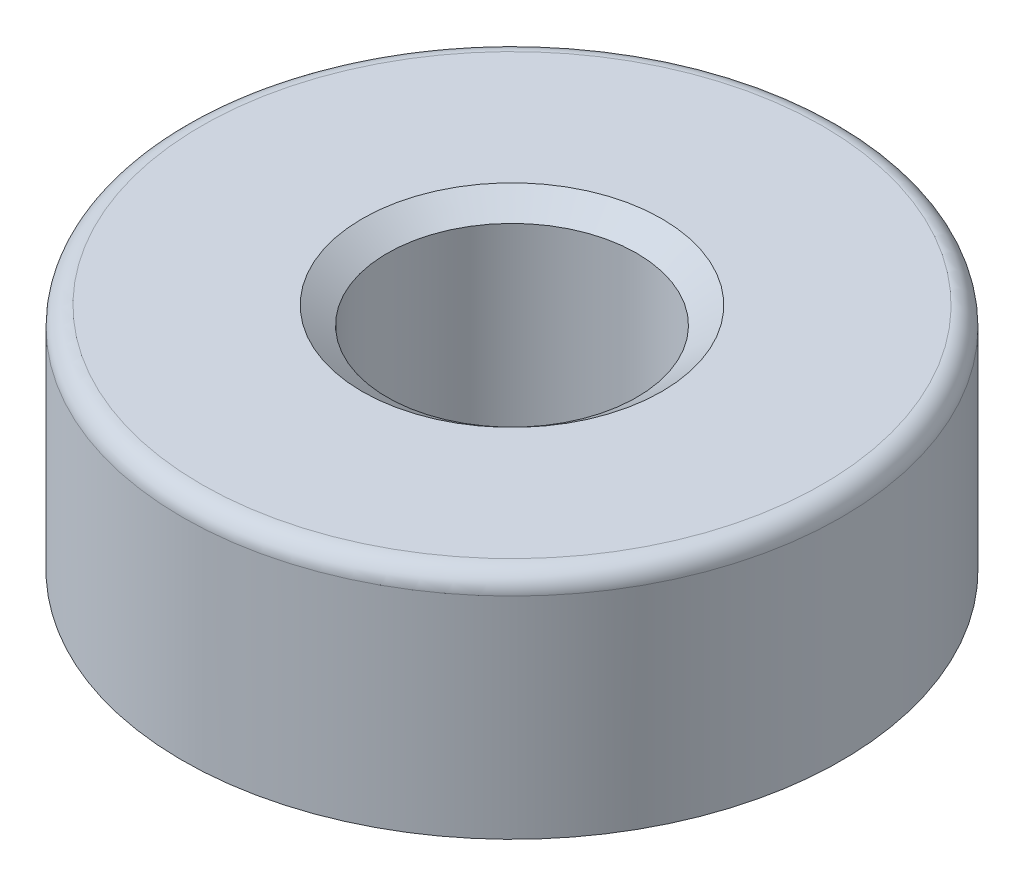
ISO-10303-21;
HEADER;
FILE_DESCRIPTION(('STEP AP214'),'2;1');
FILE_NAME('part.step','',(''),(''),'','','');
FILE_SCHEMA(('AUTOMOTIVE_DESIGN { 1 0 10303 214 1 1 1 1 }'));
ENDSEC;
DATA;
#1=APPLICATION_CONTEXT('core data for automotive mechanical design processes');
#2=APPLICATION_PROTOCOL_DEFINITION('international standard','automotive_design',2000,#1);
#3=PRODUCT_CONTEXT('',#1,'mechanical');
#4=PRODUCT('Part','Part','',(#3));
#5=PRODUCT_RELATED_PRODUCT_CATEGORY('part','',(#4));
#6=PRODUCT_DEFINITION_FORMATION('','',#4);
#7=PRODUCT_DEFINITION_CONTEXT('part definition',#1,'design');
#8=PRODUCT_DEFINITION('design','',#6,#7);
#9=PRODUCT_DEFINITION_SHAPE('','',#8);
#10=(LENGTH_UNIT() NAMED_UNIT(*) SI_UNIT(.MILLI.,.METRE.));
#11=(NAMED_UNIT(*) PLANE_ANGLE_UNIT() SI_UNIT($,.RADIAN.));
#12=(NAMED_UNIT(*) SI_UNIT($,.STERADIAN.) SOLID_ANGLE_UNIT());
#13=UNCERTAINTY_MEASURE_WITH_UNIT(LENGTH_MEASURE(1.E-05),#10,'distance_accuracy_value','');
#14=(GEOMETRIC_REPRESENTATION_CONTEXT(3) GLOBAL_UNCERTAINTY_ASSIGNED_CONTEXT((#13)) GLOBAL_UNIT_ASSIGNED_CONTEXT((#10,
#11,#12)) REPRESENTATION_CONTEXT('',''));
#15=CARTESIAN_POINT('',(0.,0.,0.));
#16=DIRECTION('',(0.,0.,1.));
#17=DIRECTION('',(1.,0.,0.));
#18=AXIS2_PLACEMENT_3D('',#15,#16,#17);
#19=CARTESIAN_POINT('',(0.,-0.62,0.));
#20=DIRECTION('',(0.,1.,0.));
#21=DIRECTION('',(0.,0.,1.));
#22=AXIS2_PLACEMENT_3D('',#19,#20,#21);
#23=CONICAL_SURFACE('',#22,5.739195,0.94660466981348);
#24=CARTESIAN_POINT('',(-4.06874801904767,-0.620199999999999,4.0472782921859));
#25=CARTESIAN_POINT('',(-4.14286310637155,-0.517112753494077,4.17564938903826));
#26=CARTESIAN_POINT('',(-4.2169246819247,-0.413872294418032,4.30392780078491));
#27=CARTESIAN_POINT('',(-4.36494079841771,-0.207084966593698,4.56029923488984));
#28=CARTESIAN_POINT('',(-4.43889533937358,-0.103538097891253,4.68839225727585));
#29=CARTESIAN_POINT('',(-4.51279636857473,0.000161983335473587,4.81639259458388));
#30=B_SPLINE_CURVE_WITH_KNOTS('',3,(#24,#25,#26,#27,#28,#29),.UNSPECIFIED.,.F.,.F.,(4,2,4),(0.,
0.54165629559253,1.08331251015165),.UNSPECIFIED.);
#31=CARTESIAN_POINT('',(-4.06889185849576,-0.62,4.04752742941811));
#32=VERTEX_POINT('',#31);
#33=CARTESIAN_POINT('',(-4.51268089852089,0.,4.81619259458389));
#34=VERTEX_POINT('',#33);
#35=EDGE_CURVE('E274',#32,#34,#30,.T.);
#36=ORIENTED_EDGE('',*,*,#35,.F.);
#37=CARTESIAN_POINT('',(0.,-0.62,0.));
#38=DIRECTION('',(0.,-1.,0.));
#39=DIRECTION('',(0.,0.,-1.));
#40=AXIS2_PLACEMENT_3D('',#37,#38,#39);
#41=CIRCLE('',#40,5.739195);
#42=CARTESIAN_POINT('',(-1.4708156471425,-0.62,5.54752742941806));
#43=VERTEX_POINT('',#42);
#44=EDGE_CURVE('E215',#43,#32,#41,.T.);
#45=ORIENTED_EDGE('',*,*,#44,.F.);
#46=CARTESIAN_POINT('',(-1.91472015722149,0.000161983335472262,6.31639259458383));
#47=CARTESIAN_POINT('',(-1.84081912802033,-0.103538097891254,6.1883922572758));
#48=CARTESIAN_POINT('',(-1.76686458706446,-0.207084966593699,6.06029923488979));
#49=CARTESIAN_POINT('',(-1.61884847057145,-0.413872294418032,5.80392780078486));
#50=CARTESIAN_POINT('',(-1.5447868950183,-0.517112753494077,5.67564938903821));
#51=CARTESIAN_POINT('',(-1.47067180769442,-0.6202,5.54727829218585));
#52=B_SPLINE_CURVE_WITH_KNOTS('',3,(#46,#47,#48,#49,#50,#51),.UNSPECIFIED.,.F.,.F.,(4,2,4),(0.,
0.541656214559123,1.08331251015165),.UNSPECIFIED.);
#53=CARTESIAN_POINT('',(-1.91460468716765,0.,6.31619259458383));
#54=VERTEX_POINT('',#53);
#55=EDGE_CURVE('E187',#54,#43,#52,.T.);
#56=ORIENTED_EDGE('',*,*,#55,.F.);
#57=CARTESIAN_POINT('',(0.,0.,0.));
#58=DIRECTION('',(0.,-1.,0.));
#59=DIRECTION('',(0.,0.,-1.));
#60=AXIS2_PLACEMENT_3D('',#57,#58,#59);
#61=CIRCLE('',#60,6.6);
#62=EDGE_CURVE('E142',#54,#34,#61,.T.);
#63=ORIENTED_EDGE('',*,*,#62,.T.);
#64=EDGE_LOOP('',(#36,#45,#56,#63));
#65=FACE_BOUND('',#64,.T.);
#66=ADVANCED_FACE('F34',(#65),#23,.T.);
#67=CARTESIAN_POINT('',(0.,0.,0.));
#68=DIRECTION('',(0.,-1.,0.));
#69=DIRECTION('',(0.,0.,-1.));
#70=AXIS2_PLACEMENT_3D('',#67,#68,#69);
#71=CONICAL_SURFACE('',#70,4.875805,0.948025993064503);
#72=CARTESIAN_POINT('',(-3.61859256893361,0.000157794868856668,3.26758618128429));
#73=CARTESIAN_POINT('',(-3.65622306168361,-0.0512666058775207,3.33276410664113));
#74=CARTESIAN_POINT('',(-3.69382633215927,-0.102770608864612,3.39789488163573));
#75=CARTESIAN_POINT('',(-3.76898426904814,-0.20591983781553,3.52807224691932));
#76=CARTESIAN_POINT('',(-3.80653893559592,-0.257565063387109,3.59311883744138));
#77=CARTESIAN_POINT('',(-3.88160569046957,-0.360979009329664,3.72313827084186));
#78=CARTESIAN_POINT('',(-3.91911777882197,-0.412747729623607,3.78811111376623));
#79=CARTESIAN_POINT('',(-3.99410416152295,-0.51639499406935,3.91799133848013));
#80=CARTESIAN_POINT('',(-4.03157845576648,-0.568273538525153,3.98289872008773));
#81=CARTESIAN_POINT('',(-4.06903612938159,-0.620200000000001,4.04777731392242));
#82=B_SPLINE_CURVE_WITH_KNOTS('',3,(#72,#73,#74,#75,#76,#77,#78,#79,#80,#81),.UNSPECIFIED.,.F.,
.F.,(4,2,2,2,4),(0.,0.273455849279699,0.546910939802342,0.820365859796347,1.09382153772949),.UNSPECIFIED.);
#83=CARTESIAN_POINT('',(-3.61870803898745,0.,3.26778618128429));
#84=VERTEX_POINT('',#83);
#85=EDGE_CURVE('E135',#84,#32,#82,.T.);
#86=ORIENTED_EDGE('',*,*,#85,.F.);
#87=CARTESIAN_POINT('',(0.,0.,0.));
#88=DIRECTION('',(0.,-1.,0.));
#89=DIRECTION('',(0.,0.,-1.));
#90=AXIS2_PLACEMENT_3D('',#87,#88,#89);
#91=CIRCLE('',#90,4.875805);
#92=CARTESIAN_POINT('',(-1.02063182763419,0.,4.76778618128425));
#93=VERTEX_POINT('',#92);
#94=EDGE_CURVE('E220',#93,#84,#91,.T.);
#95=ORIENTED_EDGE('',*,*,#94,.F.);
#96=CARTESIAN_POINT('',(-1.47095991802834,-0.6202,5.54777731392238));
#97=CARTESIAN_POINT('',(-1.43350224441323,-0.568273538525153,5.48289872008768));
#98=CARTESIAN_POINT('',(-1.39602795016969,-0.51639499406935,5.41799133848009));
#99=CARTESIAN_POINT('',(-1.32104156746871,-0.412747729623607,5.28811111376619));
#100=CARTESIAN_POINT('',(-1.28352947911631,-0.360979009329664,5.22313827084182));
#101=CARTESIAN_POINT('',(-1.20846272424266,-0.257565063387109,5.09311883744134));
#102=CARTESIAN_POINT('',(-1.17090805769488,-0.20591983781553,5.02807224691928));
#103=CARTESIAN_POINT('',(-1.09575012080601,-0.102770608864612,4.89789488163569));
#104=CARTESIAN_POINT('',(-1.05814685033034,-0.0512666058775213,4.83276410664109));
#105=CARTESIAN_POINT('',(-1.02051635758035,0.000157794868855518,4.76758618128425));
#106=B_SPLINE_CURVE_WITH_KNOTS('',3,(#96,#97,#98,#99,#100,#101,#102,#103,#104,#105),
.UNSPECIFIED.,.F.,.F.,(4,2,2,2,4),(0.,0.273455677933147,0.54691059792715,0.820365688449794,
1.09382153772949),.UNSPECIFIED.);
#107=EDGE_CURVE('E149',#43,#93,#106,.T.);
#108=ORIENTED_EDGE('',*,*,#107,.F.);
#109=ORIENTED_EDGE('',*,*,#44,.T.);
#110=EDGE_LOOP('',(#86,#95,#108,#109));
#111=FACE_BOUND('',#110,.T.);
#112=ADVANCED_FACE('F248',(#111),#71,.F.);
#113=CARTESIAN_POINT('',(-4.5127963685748,0.000161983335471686,-4.81639259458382));
#114=CARTESIAN_POINT('',(-4.43889533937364,-0.103538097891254,-4.68839225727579));
#115=CARTESIAN_POINT('',(-4.36494079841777,-0.2070849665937,-4.56029923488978));
#116=CARTESIAN_POINT('',(-4.21692468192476,-0.413872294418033,-4.30392780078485));
#117=CARTESIAN_POINT('',(-4.14286310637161,-0.517112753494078,-4.1756493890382));
#118=CARTESIAN_POINT('',(-4.06874801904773,-0.6202,-4.04727829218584));
#119=B_SPLINE_CURVE_WITH_KNOTS('',3,(#113,#114,#115,#116,#117,#118),.UNSPECIFIED.,.F.,.F.,(4,2,
4),(0.,0.541656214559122,1.08331251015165),.UNSPECIFIED.);
#120=CARTESIAN_POINT('',(-4.51268089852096,0.,-4.81619259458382));
#121=VERTEX_POINT('',#120);
#122=CARTESIAN_POINT('',(-4.06889185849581,-0.62,-4.04752742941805));
#123=VERTEX_POINT('',#122);
#124=EDGE_CURVE('E123',#121,#123,#119,.T.);
#125=ORIENTED_EDGE('',*,*,#124,.F.);
#126=CARTESIAN_POINT('',(-1.91460468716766,0.,-6.31619259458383));
#127=VERTEX_POINT('',#126);
#128=EDGE_CURVE('E132',#121,#127,#61,.T.);
#129=ORIENTED_EDGE('',*,*,#128,.T.);
#130=CARTESIAN_POINT('',(-1.47067180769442,-0.6202,-5.54727829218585));
#131=CARTESIAN_POINT('',(-1.5447868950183,-0.517112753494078,-5.67564938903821));
#132=CARTESIAN_POINT('',(-1.61884847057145,-0.413872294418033,-5.80392780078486));
#133=CARTESIAN_POINT('',(-1.76686458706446,-0.2070849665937,-6.06029923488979));
#134=CARTESIAN_POINT('',(-1.84081912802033,-0.103538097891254,-6.1883922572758));
#135=CARTESIAN_POINT('',(-1.91472015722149,0.000161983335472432,-6.31639259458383));
#136=B_SPLINE_CURVE_WITH_KNOTS('',3,(#130,#131,#132,#133,#134,#135),.UNSPECIFIED.,.F.,.F.,(4,2,
4),(0.,0.54165629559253,1.08331251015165),.UNSPECIFIED.);
#137=CARTESIAN_POINT('',(-1.4708156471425,-0.62,-5.54752742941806));
#138=VERTEX_POINT('',#137);
#139=EDGE_CURVE('E269',#138,#127,#136,.T.);
#140=ORIENTED_EDGE('',*,*,#139,.F.);
#141=EDGE_CURVE('E134',#123,#138,#41,.T.);
#142=ORIENTED_EDGE('',*,*,#141,.F.);
#143=EDGE_LOOP('',(#125,#129,#140,#142));
#144=FACE_BOUND('',#143,.T.);
#145=ADVANCED_FACE('F130',(#144),#23,.T.);
#146=CARTESIAN_POINT('',(-4.06903612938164,-0.6202,-4.04777731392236));
#147=CARTESIAN_POINT('',(-4.03157845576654,-0.568273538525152,-3.98289872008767));
#148=CARTESIAN_POINT('',(-3.994104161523,-0.51639499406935,-3.91799133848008));
#149=CARTESIAN_POINT('',(-3.91911777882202,-0.412747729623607,-3.78811111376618));
#150=CARTESIAN_POINT('',(-3.88160569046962,-0.360979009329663,-3.72313827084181));
#151=CARTESIAN_POINT('',(-3.80653893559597,-0.257565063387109,-3.59311883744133));
#152=CARTESIAN_POINT('',(-3.76898426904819,-0.20591983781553,-3.52807224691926));
#153=CARTESIAN_POINT('',(-3.69382633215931,-0.102770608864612,-3.39789488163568));
#154=CARTESIAN_POINT('',(-3.65622306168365,-0.0512666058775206,-3.33276410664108));
#155=CARTESIAN_POINT('',(-3.61859256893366,0.00015779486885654,-3.26758618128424));
#156=B_SPLINE_CURVE_WITH_KNOTS('',3,(#146,#147,#148,#149,#150,#151,#152,#153,#154,#155),
.UNSPECIFIED.,.F.,.F.,(4,2,2,2,4),(0.,0.273455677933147,0.546910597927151,0.820365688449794,
1.09382153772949),.UNSPECIFIED.);
#157=CARTESIAN_POINT('',(-3.6187080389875,0.,-3.26778618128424));
#158=VERTEX_POINT('',#157);
#159=EDGE_CURVE('E125',#123,#158,#156,.T.);
#160=ORIENTED_EDGE('',*,*,#159,.F.);
#161=ORIENTED_EDGE('',*,*,#141,.T.);
#162=CARTESIAN_POINT('',(-1.02051635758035,0.000157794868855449,-4.76758618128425));
#163=CARTESIAN_POINT('',(-1.05814685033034,-0.0512666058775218,-4.83276410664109));
#164=CARTESIAN_POINT('',(-1.09575012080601,-0.102770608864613,-4.89789488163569));
#165=CARTESIAN_POINT('',(-1.17090805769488,-0.20591983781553,-5.02807224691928));
#166=CARTESIAN_POINT('',(-1.20846272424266,-0.257565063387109,-5.09311883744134));
#167=CARTESIAN_POINT('',(-1.28352947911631,-0.360979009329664,-5.22313827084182));
#168=CARTESIAN_POINT('',(-1.32104156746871,-0.412747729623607,-5.28811111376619));
#169=CARTESIAN_POINT('',(-1.39602795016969,-0.51639499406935,-5.41799133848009));
#170=CARTESIAN_POINT('',(-1.43350224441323,-0.568273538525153,-5.48289872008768));
#171=CARTESIAN_POINT('',(-1.47095991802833,-0.6202,-5.54777731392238));
#172=B_SPLINE_CURVE_WITH_KNOTS('',3,(#162,#163,#164,#165,#166,#167,#168,#169,#170,#171),
.UNSPECIFIED.,.F.,.F.,(4,2,2,2,4),(0.,0.273455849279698,0.54691093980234,0.820365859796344,
1.09382153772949),.UNSPECIFIED.);
#173=CARTESIAN_POINT('',(-1.02063182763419,0.,-4.76778618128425));
#174=VERTEX_POINT('',#173);
#175=EDGE_CURVE('E12',#174,#138,#172,.T.);
#176=ORIENTED_EDGE('',*,*,#175,.F.);
#177=EDGE_CURVE('E223',#158,#174,#91,.T.);
#178=ORIENTED_EDGE('',*,*,#177,.F.);
#179=EDGE_LOOP('',(#160,#161,#176,#178));
#180=FACE_BOUND('',#179,.T.);
#181=ADVANCED_FACE('F254',(#180),#71,.F.);
#182=CARTESIAN_POINT('',(8.86925999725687,1.72516326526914,-1.5));
#183=CARTESIAN_POINT('',(8.61668385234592,1.5458008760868,-1.5));
#184=CARTESIAN_POINT('',(8.36401582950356,1.36656750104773,-1.5));
#185=CARTESIAN_POINT('',(7.85841621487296,1.00847231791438,-1.5));
#186=CARTESIAN_POINT('',(7.60548462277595,0.829610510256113,-1.5));
#187=CARTESIAN_POINT('',(7.09930673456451,0.472392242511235,-1.5));
#188=CARTESIAN_POINT('',(6.84606047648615,0.294035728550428,-1.5));
#189=CARTESIAN_POINT('',(6.33909502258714,-0.0620109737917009,-1.5));
#190=CARTESIAN_POINT('',(6.08537582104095,-0.239701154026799,-1.5));
#191=CARTESIAN_POINT('',(5.57723463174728,-0.594154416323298,-1.5));
#192=CARTESIAN_POINT('',(5.32281254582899,-0.770917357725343,-1.5));
#193=CARTESIAN_POINT('',(4.81299674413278,-1.12302452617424,-1.5));
#194=CARTESIAN_POINT('',(4.55760305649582,-1.29836879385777,-1.5));
#195=CARTESIAN_POINT('',(4.17333837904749,-1.55969750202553,-1.5));
#196=CARTESIAN_POINT('',(4.04504565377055,-1.64653166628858,-1.5));
#197=CARTESIAN_POINT('',(3.78795873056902,-1.81945143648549,-1.5));
#198=CARTESIAN_POINT('',(3.65916453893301,-1.90553705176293,-1.5));
#199=CARTESIAN_POINT('',(3.40091251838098,-2.07673760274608,-1.5));
#200=CARTESIAN_POINT('',(3.27145462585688,-2.16185244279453,-1.5));
#201=CARTESIAN_POINT('',(3.01163528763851,-2.33070257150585,-1.5));
#202=CARTESIAN_POINT('',(2.88127380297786,-2.41443780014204,-1.5));
#203=CARTESIAN_POINT('',(2.75033992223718,-2.49727934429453,-1.5));
#204=B_SPLINE_CURVE_WITH_KNOTS('',3,(#182,#183,#184,#185,#186,#187,#188,#189,#190,#191,#192,
#193,#194,#195,#196,#197,#198,#199,#200,#201,#202,#203),.UNSPECIFIED.,.F.,.F.,(4,2,2,2,2,2,2,2,
2,2,4),(0.,0.929349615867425,1.85870032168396,2.78794790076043,3.71720680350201,
4.64660281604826,5.57597211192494,6.04072029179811,6.50546266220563,6.9702504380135,
7.43505838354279),.UNSPECIFIED.);
#205=CARTESIAN_POINT('',(6.42728558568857,0.,-1.5));
#206=VERTEX_POINT('',#205);
#207=CARTESIAN_POINT('',(5.53970750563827,-0.62,-1.5));
#208=VERTEX_POINT('',#207);
#209=EDGE_CURVE('E265',#206,#208,#204,.T.);
#210=ORIENTED_EDGE('',*,*,#209,.F.);
#211=CARTESIAN_POINT('',(6.42728558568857,0.,1.5));
#212=VERTEX_POINT('',#211);
#213=EDGE_CURVE('E143',#206,#212,#61,.T.);
#214=ORIENTED_EDGE('',*,*,#213,.T.);
#215=CARTESIAN_POINT('',(2.75033992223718,-2.49727934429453,1.5));
#216=CARTESIAN_POINT('',(2.88127380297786,-2.41443780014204,1.5));
#217=CARTESIAN_POINT('',(3.01163528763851,-2.33070257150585,1.5));
#218=CARTESIAN_POINT('',(3.27145462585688,-2.16185244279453,1.5));
#219=CARTESIAN_POINT('',(3.40091251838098,-2.07673760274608,1.5));
#220=CARTESIAN_POINT('',(3.65916453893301,-1.90553705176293,1.5));
#221=CARTESIAN_POINT('',(3.78795873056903,-1.81945143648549,1.5));
#222=CARTESIAN_POINT('',(4.04504565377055,-1.64653166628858,1.5));
#223=CARTESIAN_POINT('',(4.17333837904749,-1.55969750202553,1.5));
#224=CARTESIAN_POINT('',(4.55760305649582,-1.29836879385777,1.5));
#225=CARTESIAN_POINT('',(4.81299674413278,-1.12302452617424,1.5));
#226=CARTESIAN_POINT('',(5.322812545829,-0.770917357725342,1.5));
#227=CARTESIAN_POINT('',(5.57723463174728,-0.594154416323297,1.5));
#228=CARTESIAN_POINT('',(6.08537582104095,-0.239701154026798,1.5));
#229=CARTESIAN_POINT('',(6.33909502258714,-0.0620109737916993,1.5));
#230=CARTESIAN_POINT('',(6.84606047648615,0.29403572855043,1.5));
#231=CARTESIAN_POINT('',(7.09930673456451,0.472392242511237,1.5));
#232=CARTESIAN_POINT('',(7.60548462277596,0.829610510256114,1.5));
#233=CARTESIAN_POINT('',(7.85841621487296,1.00847231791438,1.5));
#234=CARTESIAN_POINT('',(8.36401582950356,1.36656750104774,1.5));
#235=CARTESIAN_POINT('',(8.61668385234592,1.5458008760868,1.5));
#236=CARTESIAN_POINT('',(8.86925999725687,1.72516326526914,1.5));
#237=B_SPLINE_CURVE_WITH_KNOTS('',3,(#215,#216,#217,#218,#219,#220,#221,#222,#223,#224,#225,
#226,#227,#228,#229,#230,#231,#232,#233,#234,#235,#236),.UNSPECIFIED.,.F.,.F.,(4,2,2,2,2,2,2,2,
2,2,4),(0.,0.464807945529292,0.929595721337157,1.39433809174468,1.85908627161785,
2.78845556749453,3.71785158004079,4.64711048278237,5.57635806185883,6.50570876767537,
7.43505838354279),.UNSPECIFIED.);
#238=CARTESIAN_POINT('',(5.53970750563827,-0.62,1.5));
#239=VERTEX_POINT('',#238);
#240=EDGE_CURVE('E194',#239,#212,#237,.T.);
#241=ORIENTED_EDGE('',*,*,#240,.F.);
#242=EDGE_CURVE('E219',#208,#239,#41,.T.);
#243=ORIENTED_EDGE('',*,*,#242,.F.);
#244=EDGE_LOOP('',(#210,#214,#241,#243));
#245=FACE_BOUND('',#244,.T.);
#246=ADVANCED_FACE('F36',(#245),#23,.T.);
#247=CARTESIAN_POINT('',(0.,0.,0.));
#248=DIRECTION('',(0.,-1.,0.));
#249=DIRECTION('',(0.,0.,-1.));
#250=AXIS2_PLACEMENT_3D('',#247,#248,#249);
#251=CYLINDRICAL_SURFACE('',#250,6.6);
#252=CARTESIAN_POINT('',(0.,4.219,0.));
#253=DIRECTION('',(0.,-1.,0.));
#254=DIRECTION('',(0.,0.,-1.));
#255=AXIS2_PLACEMENT_3D('',#252,#253,#254);
#256=CIRCLE('',#255,6.6);
#257=CARTESIAN_POINT('',(0.,4.219,-6.6));
#258=VERTEX_POINT('',#257);
#259=EDGE_CURVE('E146',#258,#258,#256,.T.);
#260=ORIENTED_EDGE('',*,*,#259,.T.);
#261=EDGE_LOOP('',(#260));
#262=FACE_BOUND('',#261,.T.);
#263=EDGE_CURVE('E145',#212,#54,#61,.T.);
#264=ORIENTED_EDGE('',*,*,#263,.F.);
#265=ORIENTED_EDGE('',*,*,#213,.F.);
#266=CARTESIAN_POINT('',(0.,0.,0.));
#267=DIRECTION('',(0.,1.,0.));
#268=DIRECTION('',(0.866025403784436,0.,-0.500000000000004));
#269=AXIS2_PLACEMENT_3D('',#266,#267,#268);
#270=CIRCLE('',#269,6.6);
#271=EDGE_CURVE('E141',#206,#127,#270,.T.);
#272=ORIENTED_EDGE('',*,*,#271,.T.);
#273=ORIENTED_EDGE('',*,*,#128,.F.);
#274=CARTESIAN_POINT('',(0.,0.,0.));
#275=DIRECTION('',(0.,1.,0.));
#276=DIRECTION('',(-0.866025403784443,0.,-0.499999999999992));
#277=AXIS2_PLACEMENT_3D('',#274,#275,#276);
#278=CIRCLE('',#277,6.6);
#279=EDGE_CURVE('E110',#121,#34,#278,.T.);
#280=ORIENTED_EDGE('',*,*,#279,.T.);
#281=ORIENTED_EDGE('',*,*,#62,.F.);
#282=EDGE_LOOP('',(#264,#265,#272,#273,#280,#281));
#283=FACE_BOUND('',#282,.T.);
#284=ADVANCED_FACE('F139',(#262,#283),#251,.T.);
#285=CARTESIAN_POINT('',(0.,4.219,0.));
#286=DIRECTION('',(0.,-1.,0.));
#287=DIRECTION('',(0.,0.,-1.));
#288=AXIS2_PLACEMENT_3D('',#285,#286,#287);
#289=TOROIDAL_SURFACE('',#288,6.219,0.381000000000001);
#290=CARTESIAN_POINT('',(0.,4.6,0.));
#291=DIRECTION('',(0.,-1.,0.));
#292=DIRECTION('',(0.,0.,-1.));
#293=AXIS2_PLACEMENT_3D('',#290,#291,#292);
#294=CIRCLE('',#293,6.219);
#295=CARTESIAN_POINT('',(0.,4.6,-6.219));
#296=VERTEX_POINT('',#295);
#297=EDGE_CURVE('E229',#296,#296,#294,.T.);
#298=ORIENTED_EDGE('',*,*,#297,.T.);
#299=EDGE_LOOP('',(#298));
#300=FACE_BOUND('',#299,.T.);
#301=ORIENTED_EDGE('',*,*,#259,.F.);
#302=EDGE_LOOP('',(#301));
#303=FACE_BOUND('',#302,.T.);
#304=ADVANCED_FACE('F235',(#300,#303),#289,.T.);
#305=CARTESIAN_POINT('',(6.219,4.6,0.));
#306=DIRECTION('',(0.,1.,0.));
#307=DIRECTION('',(0.,0.,1.));
#308=AXIS2_PLACEMENT_3D('',#305,#306,#307);
#309=PLANE('',#308);
#310=CARTESIAN_POINT('',(0.,4.6,0.));
#311=DIRECTION('',(0.,-1.,0.));
#312=DIRECTION('',(0.,0.,-1.));
#313=AXIS2_PLACEMENT_3D('',#310,#311,#312);
#314=CIRCLE('',#313,3.);
#315=CARTESIAN_POINT('',(0.,4.6,-3.));
#316=VERTEX_POINT('',#315);
#317=EDGE_CURVE('E206',#316,#316,#314,.T.);
#318=ORIENTED_EDGE('',*,*,#317,.T.);
#319=EDGE_LOOP('',(#318));
#320=FACE_BOUND('',#319,.T.);
#321=ORIENTED_EDGE('',*,*,#297,.F.);
#322=EDGE_LOOP('',(#321));
#323=FACE_BOUND('',#322,.T.);
#324=ADVANCED_FACE('F237',(#320,#323),#309,.T.);
#325=CARTESIAN_POINT('',(0.,0.,0.));
#326=DIRECTION('',(0.,-1.,0.));
#327=DIRECTION('',(0.,0.,-1.));
#328=AXIS2_PLACEMENT_3D('',#325,#326,#327);
#329=CYLINDRICAL_SURFACE('',#328,2.5);
#330=CARTESIAN_POINT('',(0.,4.25002626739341,0.));
#331=DIRECTION('',(0.,-1.,0.));
#332=DIRECTION('',(0.,0.,-1.));
#333=AXIS2_PLACEMENT_3D('',#330,#331,#332);
#334=CIRCLE('',#333,2.5);
#335=CARTESIAN_POINT('',(0.,4.25002626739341,-2.5));
#336=VERTEX_POINT('',#335);
#337=EDGE_CURVE('E203',#336,#336,#334,.T.);
#338=ORIENTED_EDGE('',*,*,#337,.F.);
#339=EDGE_LOOP('',(#338));
#340=FACE_BOUND('',#339,.T.);
#341=CARTESIAN_POINT('',(0.,-0.636026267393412,0.));
#342=DIRECTION('',(0.,-1.,0.));
#343=DIRECTION('',(0.,0.,-1.));
#344=AXIS2_PLACEMENT_3D('',#341,#342,#343);
#345=CIRCLE('',#344,2.5);
#346=CARTESIAN_POINT('',(0.,-0.636026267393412,-2.5));
#347=VERTEX_POINT('',#346);
#348=EDGE_CURVE('E212',#347,#347,#345,.T.);
#349=ORIENTED_EDGE('',*,*,#348,.T.);
#350=EDGE_LOOP('',(#349));
#351=FACE_BOUND('',#350,.T.);
#352=ADVANCED_FACE('F244',(#340,#351),#329,.F.);
#353=CARTESIAN_POINT('',(2.5,-1.24,0.));
#354=DIRECTION('',(0.,-1.,0.));
#355=DIRECTION('',(0.,0.,-1.));
#356=AXIS2_PLACEMENT_3D('',#353,#354,#355);
#357=PLANE('',#356);
#358=CARTESIAN_POINT('',(0.,-1.24,0.));
#359=DIRECTION('',(0.,-1.,0.));
#360=DIRECTION('',(0.,0.,-1.));
#361=AXIS2_PLACEMENT_3D('',#358,#359,#360);
#362=CIRCLE('',#361,3.);
#363=CARTESIAN_POINT('',(0.,-1.24,-3.));
#364=VERTEX_POINT('',#363);
#365=EDGE_CURVE('E165',#364,#364,#362,.T.);
#366=ORIENTED_EDGE('',*,*,#365,.F.);
#367=EDGE_LOOP('',(#366));
#368=FACE_BOUND('',#367,.T.);
#369=CARTESIAN_POINT('',(0.,-1.24,0.));
#370=DIRECTION('',(0.,-1.,0.));
#371=DIRECTION('',(0.,0.,-1.));
#372=AXIS2_PLACEMENT_3D('',#369,#370,#371);
#373=CIRCLE('',#372,4.015);
#374=CARTESIAN_POINT('',(0.,-1.24,-4.015));
#375=VERTEX_POINT('',#374);
#376=EDGE_CURVE('E226',#375,#375,#373,.T.);
#377=ORIENTED_EDGE('',*,*,#376,.T.);
#378=EDGE_LOOP('',(#377));
#379=FACE_BOUND('',#378,.T.);
#380=ADVANCED_FACE('F316',(#368,#379),#357,.T.);
#381=CARTESIAN_POINT('',(0.,0.,0.));
#382=DIRECTION('',(0.,-1.,0.));
#383=DIRECTION('',(0.,0.,-1.));
#384=AXIS2_PLACEMENT_3D('',#381,#382,#383);
#385=CYLINDRICAL_SURFACE('',#384,4.015);
#386=CARTESIAN_POINT('',(0.,0.,0.));
#387=DIRECTION('',(0.,-1.,0.));
#388=DIRECTION('',(0.,0.,-1.));
#389=AXIS2_PLACEMENT_3D('',#386,#387,#388);
#390=CIRCLE('',#389,4.015);
#391=CARTESIAN_POINT('',(0.,0.,-4.015));
#392=VERTEX_POINT('',#391);
#393=EDGE_CURVE('E222',#392,#392,#390,.T.);
#394=ORIENTED_EDGE('',*,*,#393,.T.);
#395=EDGE_LOOP('',(#394));
#396=FACE_BOUND('',#395,.T.);
#397=ORIENTED_EDGE('',*,*,#376,.F.);
#398=EDGE_LOOP('',(#397));
#399=FACE_BOUND('',#398,.T.);
#400=ADVANCED_FACE('F319',(#396,#399),#385,.T.);
#401=CARTESIAN_POINT('',(4.015,0.,0.));
#402=DIRECTION('',(0.,-1.,0.));
#403=DIRECTION('',(0.,0.,-1.));
#404=AXIS2_PLACEMENT_3D('',#401,#402,#403);
#405=PLANE('',#404);
#406=ORIENTED_EDGE('',*,*,#94,.T.);
#407=DIRECTION('',(0.499999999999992,0.,-0.866025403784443));
#408=VECTOR('',#407,1.);
#409=CARTESIAN_POINT('',(-3.61870803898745,0.,3.26778618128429));
#410=LINE('',#409,#408);
#411=EDGE_CURVE('E114',#34,#84,#410,.T.);
#412=ORIENTED_EDGE('',*,*,#411,.F.);
#413=ORIENTED_EDGE('',*,*,#279,.F.);
#414=DIRECTION('',(-0.500000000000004,0.,-0.866025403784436));
#415=VECTOR('',#414,1.);
#416=CARTESIAN_POINT('',(-3.6187080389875,0.,-3.26778618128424));
#417=LINE('',#416,#415);
#418=EDGE_CURVE('E56',#158,#121,#417,.T.);
#419=ORIENTED_EDGE('',*,*,#418,.F.);
#420=ORIENTED_EDGE('',*,*,#177,.T.);
#421=DIRECTION('',(0.500000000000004,0.,0.866025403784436));
#422=VECTOR('',#421,1.);
#423=CARTESIAN_POINT('',(-1.02063182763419,0.,-4.76778618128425));
#424=LINE('',#423,#422);
#425=EDGE_CURVE('E270',#127,#174,#424,.T.);
#426=ORIENTED_EDGE('',*,*,#425,.F.);
#427=ORIENTED_EDGE('',*,*,#271,.F.);
#428=DIRECTION('',(1.,0.,0.));
#429=VECTOR('',#428,1.);
#430=CARTESIAN_POINT('',(4.63933986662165,0.,-1.5));
#431=LINE('',#430,#429);
#432=CARTESIAN_POINT('',(4.63933986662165,0.,-1.5));
#433=VERTEX_POINT('',#432);
#434=EDGE_CURVE('E63',#433,#206,#431,.T.);
#435=ORIENTED_EDGE('',*,*,#434,.F.);
#436=CARTESIAN_POINT('',(4.63933986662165,0.,1.5));
#437=VERTEX_POINT('',#436);
#438=EDGE_CURVE('E218',#433,#437,#91,.T.);
#439=ORIENTED_EDGE('',*,*,#438,.T.);
#440=DIRECTION('',(-1.,0.,0.));
#441=VECTOR('',#440,1.);
#442=CARTESIAN_POINT('',(4.63933986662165,0.,1.5));
#443=LINE('',#442,#441);
#444=EDGE_CURVE('E195',#212,#437,#443,.T.);
#445=ORIENTED_EDGE('',*,*,#444,.F.);
#446=ORIENTED_EDGE('',*,*,#263,.T.);
#447=DIRECTION('',(-0.500000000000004,0.,0.866025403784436));
#448=VECTOR('',#447,1.);
#449=CARTESIAN_POINT('',(-1.02063182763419,0.,4.76778618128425));
#450=LINE('',#449,#448);
#451=EDGE_CURVE('E275',#93,#54,#450,.T.);
#452=ORIENTED_EDGE('',*,*,#451,.F.);
#453=EDGE_LOOP('',(#406,#412,#413,#419,#420,#426,#427,#435,#439,#445,#446,#452));
#454=FACE_BOUND('',#453,.T.);
#455=ORIENTED_EDGE('',*,*,#393,.F.);
#456=EDGE_LOOP('',(#455));
#457=FACE_BOUND('',#456,.T.);
#458=ADVANCED_FACE('F112',(#454,#457),#405,.T.);
#459=CARTESIAN_POINT('',(7.17434300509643,-1.76197910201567,-1.5));
#460=CARTESIAN_POINT('',(7.00499711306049,-1.6429508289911,-1.5));
#461=CARTESIAN_POINT('',(6.83557260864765,-1.52403413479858,-1.5));
#462=CARTESIAN_POINT('',(6.49651646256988,-1.28649472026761,-1.5));
#463=CARTESIAN_POINT('',(6.32688481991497,-1.16787200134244,-1.5));
#464=CARTESIAN_POINT('',(5.98737876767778,-0.931001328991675,-1.5));
#465=CARTESIAN_POINT('',(5.81750437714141,-0.812753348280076,-1.5));
#466=CARTESIAN_POINT('',(5.47742902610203,-0.576728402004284,-1.5));
#467=CARTESIAN_POINT('',(5.30722806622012,-0.458951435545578,-1.5));
#468=CARTESIAN_POINT('',(4.96638649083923,-0.224004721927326,-1.5));
#469=CARTESIAN_POINT('',(4.7957458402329,-0.106835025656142,-1.5));
#470=CARTESIAN_POINT('',(4.45389807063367,0.126671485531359,-1.5));
#471=CARTESIAN_POINT('',(4.28269095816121,0.243008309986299,-1.5));
#472=CARTESIAN_POINT('',(3.93948394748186,0.47453815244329,-1.5));
#473=CARTESIAN_POINT('',(3.7674839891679,0.589731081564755,-1.5));
#474=CARTESIAN_POINT('',(3.50864764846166,0.761266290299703,-1.5));
#475=CARTESIAN_POINT('',(3.42222779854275,0.818236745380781,-1.5));
#476=CARTESIAN_POINT('',(3.2490451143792,0.931655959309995,-1.5));
#477=CARTESIAN_POINT('',(3.16228227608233,0.988104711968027,-1.5));
#478=CARTESIAN_POINT('',(3.07531633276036,1.04424050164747,-1.5));
#479=B_SPLINE_CURVE_WITH_KNOTS('',3,(#459,#460,#461,#462,#463,#464,#465,#466,#467,#468,#469,
#470,#471,#472,#473,#474,#475,#476,#477,#478),.UNSPECIFIED.,.F.,.F.,(4,2,2,2,2,2,2,2,2,4),(0.,
0.620976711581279,1.24195640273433,1.86288978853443,2.48382199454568,3.10480541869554,
3.72578171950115,4.34680589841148,4.65732992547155,4.96785763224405),.UNSPECIFIED.);
#480=EDGE_CURVE('E49',#208,#433,#479,.T.);
#481=ORIENTED_EDGE('',*,*,#480,.F.);
#482=ORIENTED_EDGE('',*,*,#242,.T.);
#483=CARTESIAN_POINT('',(3.07531633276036,1.04424050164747,1.5));
#484=CARTESIAN_POINT('',(3.16228227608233,0.988104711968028,1.5));
#485=CARTESIAN_POINT('',(3.2490451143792,0.931655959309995,1.5));
#486=CARTESIAN_POINT('',(3.42222779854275,0.818236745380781,1.5));
#487=CARTESIAN_POINT('',(3.50864764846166,0.761266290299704,1.5));
#488=CARTESIAN_POINT('',(3.7674839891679,0.589731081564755,1.5));
#489=CARTESIAN_POINT('',(3.93948394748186,0.474538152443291,1.5));
#490=CARTESIAN_POINT('',(4.28269095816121,0.243008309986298,1.5));
#491=CARTESIAN_POINT('',(4.45389807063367,0.126671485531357,1.5));
#492=CARTESIAN_POINT('',(4.79574584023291,-0.10683502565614,1.5));
#493=CARTESIAN_POINT('',(4.96638649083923,-0.224004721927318,1.5));
#494=CARTESIAN_POINT('',(5.30722806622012,-0.458951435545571,1.5));
#495=CARTESIAN_POINT('',(5.47742902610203,-0.576728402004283,1.5));
#496=CARTESIAN_POINT('',(5.81750437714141,-0.812753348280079,1.5));
#497=CARTESIAN_POINT('',(5.98737876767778,-0.931001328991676,1.5));
#498=CARTESIAN_POINT('',(6.32688481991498,-1.16787200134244,1.5));
#499=CARTESIAN_POINT('',(6.49651646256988,-1.28649472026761,1.5));
#500=CARTESIAN_POINT('',(6.83557260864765,-1.52403413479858,1.5));
#501=CARTESIAN_POINT('',(7.00499711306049,-1.6429508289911,1.5));
#502=CARTESIAN_POINT('',(7.17434300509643,-1.76197910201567,1.5));
#503=B_SPLINE_CURVE_WITH_KNOTS('',3,(#483,#484,#485,#486,#487,#488,#489,#490,#491,#492,#493,
#494,#495,#496,#497,#498,#499,#500,#501,#502),.UNSPECIFIED.,.F.,.F.,(4,2,2,2,2,2,2,2,2,4),(0.,
0.310527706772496,0.621051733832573,1.2420759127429,1.86305221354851,2.48403563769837,
3.10496784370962,3.72590122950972,4.34688092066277,4.96785763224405),.UNSPECIFIED.);
#504=EDGE_CURVE('E153',#437,#239,#503,.T.);
#505=ORIENTED_EDGE('',*,*,#504,.F.);
#506=ORIENTED_EDGE('',*,*,#438,.F.);
#507=EDGE_LOOP('',(#481,#482,#505,#506));
#508=FACE_BOUND('',#507,.T.);
#509=ADVANCED_FACE('F171',(#508),#71,.F.);
#510=CARTESIAN_POINT('',(0.,-0.986,0.));
#511=DIRECTION('',(0.,-1.,0.));
#512=DIRECTION('',(0.,0.,-1.));
#513=AXIS2_PLACEMENT_3D('',#510,#511,#512);
#514=CONICAL_SURFACE('',#513,3.,0.960105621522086);
#515=ORIENTED_EDGE('',*,*,#348,.F.);
#516=EDGE_LOOP('',(#515));
#517=FACE_BOUND('',#516,.T.);
#518=CARTESIAN_POINT('',(0.,-0.986,0.));
#519=DIRECTION('',(0.,-1.,0.));
#520=DIRECTION('',(0.,0.,-1.));
#521=AXIS2_PLACEMENT_3D('',#518,#519,#520);
#522=CIRCLE('',#521,3.);
#523=CARTESIAN_POINT('',(0.,-0.986,-3.));
#524=VERTEX_POINT('',#523);
#525=EDGE_CURVE('E209',#524,#524,#522,.T.);
#526=ORIENTED_EDGE('',*,*,#525,.T.);
#527=EDGE_LOOP('',(#526));
#528=FACE_BOUND('',#527,.T.);
#529=ADVANCED_FACE('F338',(#517,#528),#514,.F.);
#530=CARTESIAN_POINT('',(0.,-2.54,0.));
#531=DIRECTION('',(0.,-1.,0.));
#532=DIRECTION('',(0.,0.,-1.));
#533=AXIS2_PLACEMENT_3D('',#530,#531,#532);
#534=CYLINDRICAL_SURFACE('',#533,3.);
#535=ORIENTED_EDGE('',*,*,#365,.T.);
#536=EDGE_LOOP('',(#535));
#537=FACE_BOUND('',#536,.T.);
#538=ORIENTED_EDGE('',*,*,#525,.F.);
#539=EDGE_LOOP('',(#538));
#540=FACE_BOUND('',#539,.T.);
#541=ADVANCED_FACE('F313',(#537,#540),#534,.F.);
#542=CARTESIAN_POINT('',(0.,4.25002626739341,0.));
#543=DIRECTION('',(0.,1.,0.));
#544=DIRECTION('',(0.,0.,1.));
#545=AXIS2_PLACEMENT_3D('',#542,#543,#544);
#546=CONICAL_SURFACE('',#545,2.5,0.960105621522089);
#547=ORIENTED_EDGE('',*,*,#317,.F.);
#548=EDGE_LOOP('',(#547));
#549=FACE_BOUND('',#548,.T.);
#550=ORIENTED_EDGE('',*,*,#337,.T.);
#551=EDGE_LOOP('',(#550));
#552=FACE_BOUND('',#551,.T.);
#553=ADVANCED_FACE('F183',(#549,#552),#546,.F.);
#554=CARTESIAN_POINT('',(4.63933986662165,-6.35,1.5));
#555=DIRECTION('',(0.,0.,-1.));
#556=DIRECTION('',(-1.,0.,0.));
#557=AXIS2_PLACEMENT_3D('',#554,#555,#556);
#558=PLANE('',#557);
#559=ORIENTED_EDGE('',*,*,#240,.T.);
#560=ORIENTED_EDGE('',*,*,#444,.T.);
#561=ORIENTED_EDGE('',*,*,#504,.T.);
#562=EDGE_LOOP('',(#559,#560,#561));
#563=FACE_BOUND('',#562,.T.);
#564=ADVANCED_FACE('F180',(#563),#558,.F.);
#565=CARTESIAN_POINT('',(-1.02063182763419,-6.35,4.76778618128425));
#566=DIRECTION('',(-0.866025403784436,0.,-0.500000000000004));
#567=DIRECTION('',(-0.500000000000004,0.,0.866025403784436));
#568=AXIS2_PLACEMENT_3D('',#565,#566,#567);
#569=PLANE('',#568);
#570=ORIENTED_EDGE('',*,*,#55,.T.);
#571=ORIENTED_EDGE('',*,*,#107,.T.);
#572=ORIENTED_EDGE('',*,*,#451,.T.);
#573=EDGE_LOOP('',(#570,#571,#572));
#574=FACE_BOUND('',#573,.T.);
#575=ADVANCED_FACE('F175',(#574),#569,.F.);
#576=CARTESIAN_POINT('',(-1.02063182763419,-6.35,-4.76778618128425));
#577=DIRECTION('',(-0.866025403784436,0.,0.500000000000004));
#578=DIRECTION('',(0.500000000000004,0.,0.866025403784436));
#579=AXIS2_PLACEMENT_3D('',#576,#577,#578);
#580=PLANE('',#579);
#581=ORIENTED_EDGE('',*,*,#139,.T.);
#582=ORIENTED_EDGE('',*,*,#425,.T.);
#583=ORIENTED_EDGE('',*,*,#175,.T.);
#584=EDGE_LOOP('',(#581,#582,#583));
#585=FACE_BOUND('',#584,.T.);
#586=ADVANCED_FACE('F179',(#585),#580,.F.);
#587=CARTESIAN_POINT('',(4.63933986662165,-6.35,-1.5));
#588=DIRECTION('',(0.,0.,1.));
#589=DIRECTION('',(1.,0.,0.));
#590=AXIS2_PLACEMENT_3D('',#587,#588,#589);
#591=PLANE('',#590);
#592=ORIENTED_EDGE('',*,*,#209,.T.);
#593=ORIENTED_EDGE('',*,*,#480,.T.);
#594=ORIENTED_EDGE('',*,*,#434,.T.);
#595=EDGE_LOOP('',(#592,#593,#594));
#596=FACE_BOUND('',#595,.T.);
#597=ADVANCED_FACE('F291',(#596),#591,.F.);
#598=CARTESIAN_POINT('',(-3.61870803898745,-6.35,3.26778618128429));
#599=DIRECTION('',(0.866025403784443,0.,0.499999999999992));
#600=DIRECTION('',(0.499999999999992,0.,-0.866025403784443));
#601=AXIS2_PLACEMENT_3D('',#598,#599,#600);
#602=PLANE('',#601);
#603=ORIENTED_EDGE('',*,*,#35,.T.);
#604=ORIENTED_EDGE('',*,*,#411,.T.);
#605=ORIENTED_EDGE('',*,*,#85,.T.);
#606=EDGE_LOOP('',(#603,#604,#605));
#607=FACE_BOUND('',#606,.T.);
#608=ADVANCED_FACE('F298',(#607),#602,.F.);
#609=CARTESIAN_POINT('',(-3.6187080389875,-6.35,-3.26778618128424));
#610=DIRECTION('',(0.866025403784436,0.,-0.500000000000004));
#611=DIRECTION('',(-0.500000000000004,0.,-0.866025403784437));
#612=AXIS2_PLACEMENT_3D('',#609,#610,#611);
#613=PLANE('',#612);
#614=ORIENTED_EDGE('',*,*,#124,.T.);
#615=ORIENTED_EDGE('',*,*,#159,.T.);
#616=ORIENTED_EDGE('',*,*,#418,.T.);
#617=EDGE_LOOP('',(#614,#615,#616));
#618=FACE_BOUND('',#617,.T.);
#619=ADVANCED_FACE('F122',(#618),#613,.F.);
#620=CLOSED_SHELL('',(#66,#112,#145,#181,#246,#284,#304,#324,#352,#380,#400,#458,#509,#529,#541,
#553,#564,#575,#586,#597,#608,#619));
#621=MANIFOLD_SOLID_BREP('B2',#620);
#622=ADVANCED_BREP_SHAPE_REPRESENTATION('',(#18,#621),#14);
#623=SHAPE_DEFINITION_REPRESENTATION(#9,#622);
ENDSEC;
END-ISO-10303-21;
